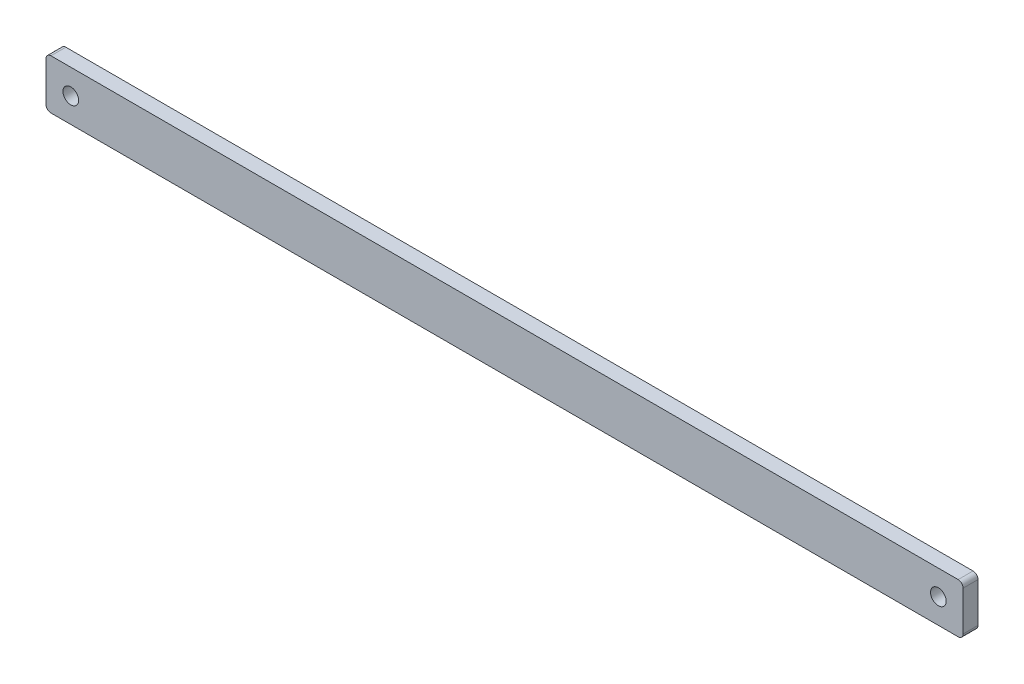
from build123d import *

# Parameters (mm, degrees)
SKETCH1_W           = 469.9
SKETCH1_H           = 25.4
BOSS_EXTRUDE1_DEPTH = 7.62
SKETCH2_R           = 4
CUT_EXTRUDE1_DEPTH  = 471.647675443
FILLET1_R           = 2.54


with BuildPart() as part:
    # Sketch1 → Boss-Extrude1 (new body)
    with BuildSketch(Plane.XY):
        with Locations((234.95, 12.7)):
            Rectangle(SKETCH1_W, SKETCH1_H)
    extrude(amount=BOSS_EXTRUDE1_DEPTH)

    # Sketch2 → Cut-Extrude1 (cut, through all)
    with BuildSketch(Plane.XY.offset(7.62)):
        with Locations((12.7, 12.7)):
            Circle(SKETCH2_R)
    cut_extrude1 = extrude(amount=-CUT_EXTRUDE1_DEPTH, mode=Mode.SUBTRACT)

    # Mirror1: Cut-Extrude1 across plane
    add(cut_extrude1.mirror(Plane(origin=(234.95, 0, 0), x_dir=(0, 0, 1), z_dir=(1, 0, 0))), mode=Mode.SUBTRACT)

    # Fillet1
    fillet1_edges = [part.edges().sort_by_distance(p)[0] for p in [
        (0, 25.4, 3.81),
        (469.9, 25.4, 3.81),
        (469.9, 0, 3.81),
        (0, 0, 3.81),
    ]]
    fillet(fillet1_edges, radius=FILLET1_R)


solid = part.part
